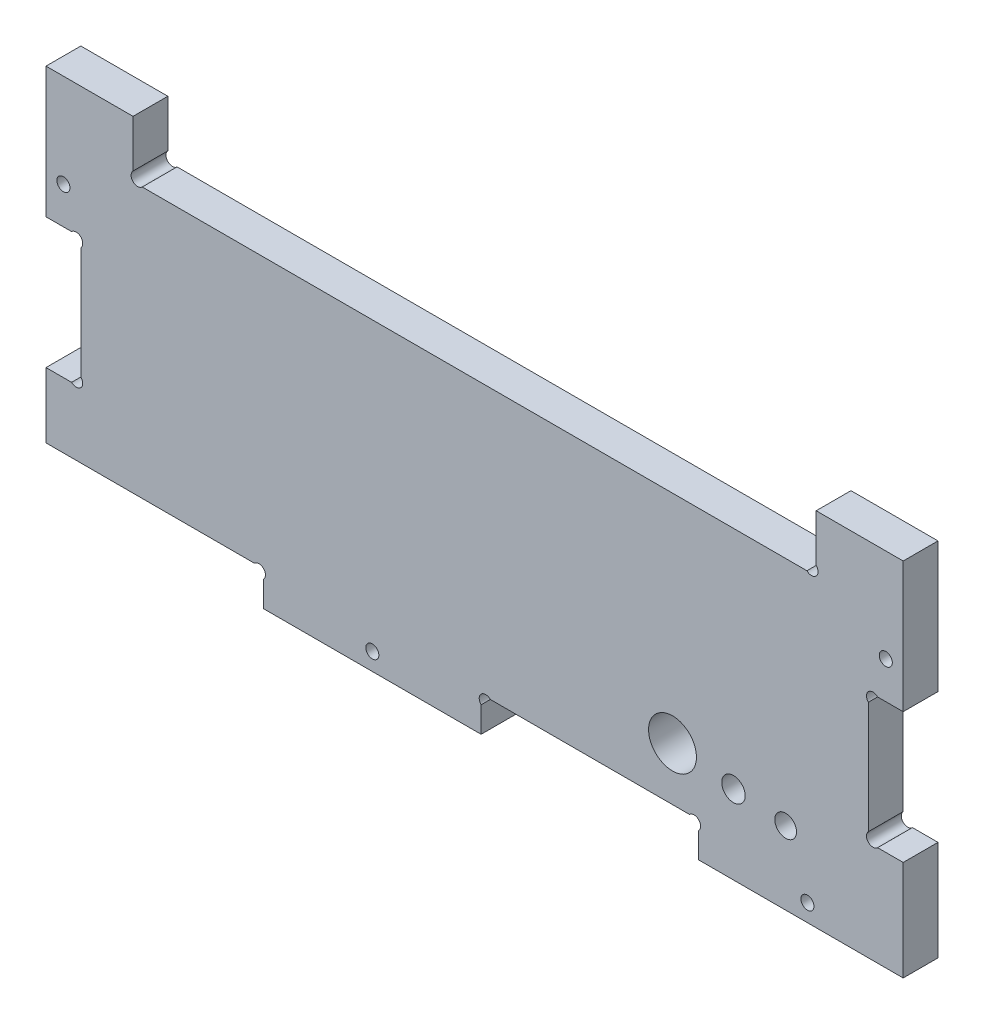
ISO-10303-21;
HEADER;
FILE_DESCRIPTION(('STEP AP214'),'2;1');
FILE_NAME('part.step','',(''),(''),'','','');
FILE_SCHEMA(('AUTOMOTIVE_DESIGN { 1 0 10303 214 1 1 1 1 }'));
ENDSEC;
DATA;
#1=APPLICATION_CONTEXT('core data for automotive mechanical design processes');
#2=APPLICATION_PROTOCOL_DEFINITION('international standard','automotive_design',2000,#1);
#3=PRODUCT_CONTEXT('',#1,'mechanical');
#4=PRODUCT('Part','Part','',(#3));
#5=PRODUCT_RELATED_PRODUCT_CATEGORY('part','',(#4));
#6=PRODUCT_DEFINITION_FORMATION('','',#4);
#7=PRODUCT_DEFINITION_CONTEXT('part definition',#1,'design');
#8=PRODUCT_DEFINITION('design','',#6,#7);
#9=PRODUCT_DEFINITION_SHAPE('','',#8);
#10=(LENGTH_UNIT() NAMED_UNIT(*) SI_UNIT(.MILLI.,.METRE.));
#11=(NAMED_UNIT(*) PLANE_ANGLE_UNIT() SI_UNIT($,.RADIAN.));
#12=(NAMED_UNIT(*) SI_UNIT($,.STERADIAN.) SOLID_ANGLE_UNIT());
#13=UNCERTAINTY_MEASURE_WITH_UNIT(LENGTH_MEASURE(1.E-05),#10,'distance_accuracy_value','');
#14=(GEOMETRIC_REPRESENTATION_CONTEXT(3) GLOBAL_UNCERTAINTY_ASSIGNED_CONTEXT((#13)) GLOBAL_UNIT_ASSIGNED_CONTEXT((#10,
#11,#12)) REPRESENTATION_CONTEXT('',''));
#15=CARTESIAN_POINT('',(0.,0.,0.));
#16=DIRECTION('',(0.,0.,1.));
#17=DIRECTION('',(1.,0.,0.));
#18=AXIS2_PLACEMENT_3D('',#15,#16,#17);
#19=CARTESIAN_POINT('',(-169.876335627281,-0.556227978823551,8.));
#20=DIRECTION('',(0.,0.,1.));
#21=DIRECTION('',(1.,0.,0.));
#22=AXIS2_PLACEMENT_3D('',#19,#20,#21);
#23=PLANE('',#22);
#24=CARTESIAN_POINT('',(-172.815675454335,36.8831118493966,8.));
#25=DIRECTION('',(0.,0.,1.));
#26=DIRECTION('',(1.,0.,0.));
#27=AXIS2_PLACEMENT_3D('',#24,#25,#26);
#28=CIRCLE('',#27,1.5);
#29=CARTESIAN_POINT('',(-171.315675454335,36.8831118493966,8.));
#30=VERTEX_POINT('',#29);
#31=EDGE_CURVE('E553',#30,#30,#28,.T.);
#32=ORIENTED_EDGE('',*,*,#31,.F.);
#33=EDGE_LOOP('',(#32));
#34=FACE_BOUND('',#33,.T.);
#35=CARTESIAN_POINT('',(-101.815675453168,-20.6168881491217,8.));
#36=DIRECTION('',(0.,0.,1.));
#37=DIRECTION('',(1.,0.,0.));
#38=AXIS2_PLACEMENT_3D('',#35,#36,#37);
#39=CIRCLE('',#38,1.5);
#40=CARTESIAN_POINT('',(-100.315675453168,-20.6168881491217,8.));
#41=VERTEX_POINT('',#40);
#42=EDGE_CURVE('E565',#41,#41,#39,.T.);
#43=ORIENTED_EDGE('',*,*,#42,.F.);
#44=EDGE_LOOP('',(#43));
#45=FACE_BOUND('',#44,.T.);
#46=CARTESIAN_POINT('',(-18.817975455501,-6.51688815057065,8.));
#47=DIRECTION('',(0.,0.,1.));
#48=DIRECTION('',(1.,0.,0.));
#49=AXIS2_PLACEMENT_3D('',#46,#47,#48);
#50=CIRCLE('',#49,2.7);
#51=CARTESIAN_POINT('',(-16.117975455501,-6.51688815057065,8.));
#52=VERTEX_POINT('',#51);
#53=EDGE_CURVE('E577',#52,#52,#50,.T.);
#54=ORIENTED_EDGE('',*,*,#53,.F.);
#55=EDGE_LOOP('',(#54));
#56=FACE_BOUND('',#55,.T.);
#57=DIRECTION('',(1.,0.,0.));
#58=VECTOR('',#57,1.);
#59=CARTESIAN_POINT('',(-128.936995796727,-16.6168881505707,8.));
#60=LINE('',#59,#58);
#61=CARTESIAN_POINT('',(-176.815675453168,-16.6168881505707,8.));
#62=VERTEX_POINT('',#61);
#63=CARTESIAN_POINT('',(-128.936995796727,-16.6168881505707,8.));
#64=VERTEX_POINT('',#63);
#65=EDGE_CURVE('E331',#62,#64,#60,.T.);
#66=ORIENTED_EDGE('',*,*,#65,.T.);
#67=CARTESIAN_POINT('',(-127.876335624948,-17.6775483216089,8.));
#68=DIRECTION('',(0.,0.,-1.));
#69=DIRECTION('',(1.,0.,0.));
#70=AXIS2_PLACEMENT_3D('',#67,#68,#69);
#71=CIRCLE('',#70,1.49999999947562);
#72=CARTESIAN_POINT('',(-126.815675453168,-18.7382084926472,8.));
#73=VERTEX_POINT('',#72);
#74=EDGE_CURVE('E161',#64,#73,#71,.T.);
#75=ORIENTED_EDGE('',*,*,#74,.T.);
#76=DIRECTION('',(0.,-1.,0.));
#77=VECTOR('',#76,1.);
#78=CARTESIAN_POINT('',(-126.815675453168,-24.6168881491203,8.));
#79=LINE('',#78,#77);
#80=CARTESIAN_POINT('',(-126.815675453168,-24.6168881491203,8.));
#81=VERTEX_POINT('',#80);
#82=EDGE_CURVE('E415',#73,#81,#79,.T.);
#83=ORIENTED_EDGE('',*,*,#82,.T.);
#84=DIRECTION('',(1.,0.,0.));
#85=VECTOR('',#84,1.);
#86=CARTESIAN_POINT('',(-76.8156754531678,-24.6168881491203,8.));
#87=LINE('',#86,#85);
#88=CARTESIAN_POINT('',(-76.8156754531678,-24.6168881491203,8.));
#89=VERTEX_POINT('',#88);
#90=EDGE_CURVE('E434',#81,#89,#87,.T.);
#91=ORIENTED_EDGE('',*,*,#90,.T.);
#92=DIRECTION('',(0.,1.,0.));
#93=VECTOR('',#92,1.);
#94=CARTESIAN_POINT('',(-76.8156754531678,-18.7382084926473,8.));
#95=LINE('',#94,#93);
#96=CARTESIAN_POINT('',(-76.8156754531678,-18.7382084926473,8.));
#97=VERTEX_POINT('',#96);
#98=EDGE_CURVE('E431',#89,#97,#95,.T.);
#99=ORIENTED_EDGE('',*,*,#98,.T.);
#100=CARTESIAN_POINT('',(-75.7550152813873,-17.6775483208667,8.));
#101=DIRECTION('',(0.,0.,-1.));
#102=DIRECTION('',(1.,0.,0.));
#103=AXIS2_PLACEMENT_3D('',#100,#101,#102);
#104=CIRCLE('',#103,1.50000000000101);
#105=CARTESIAN_POINT('',(-74.6943551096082,-16.6168881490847,8.));
#106=VERTEX_POINT('',#105);
#107=EDGE_CURVE('E433',#97,#106,#104,.T.);
#108=ORIENTED_EDGE('',*,*,#107,.T.);
#109=DIRECTION('',(1.,0.,0.));
#110=VECTOR('',#109,1.);
#111=CARTESIAN_POINT('',(-74.6943551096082,-16.6168881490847,8.));
#112=LINE('',#111,#110);
#113=CARTESIAN_POINT('',(-28.9369957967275,-16.6168881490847,8.));
#114=VERTEX_POINT('',#113);
#115=EDGE_CURVE('E436',#106,#114,#112,.T.);
#116=ORIENTED_EDGE('',*,*,#115,.T.);
#117=CARTESIAN_POINT('',(-27.8763356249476,-17.677548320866,8.));
#118=DIRECTION('',(0.,0.,-1.));
#119=DIRECTION('',(1.,0.,0.));
#120=AXIS2_PLACEMENT_3D('',#117,#118,#119);
#121=CIRCLE('',#120,1.500000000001);
#122=CARTESIAN_POINT('',(-26.8156754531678,-18.7382084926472,8.));
#123=VERTEX_POINT('',#122);
#124=EDGE_CURVE('E442',#114,#123,#121,.T.);
#125=ORIENTED_EDGE('',*,*,#124,.T.);
#126=DIRECTION('',(0.,-1.,0.));
#127=VECTOR('',#126,1.);
#128=CARTESIAN_POINT('',(-26.8156754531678,-24.6168881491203,8.));
#129=LINE('',#128,#127);
#130=CARTESIAN_POINT('',(-26.8156754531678,-24.6168881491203,8.));
#131=VERTEX_POINT('',#130);
#132=EDGE_CURVE('E444',#123,#131,#129,.T.);
#133=ORIENTED_EDGE('',*,*,#132,.T.);
#134=DIRECTION('',(1.,0.,0.));
#135=VECTOR('',#134,1.);
#136=CARTESIAN_POINT('',(20.1843245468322,-24.6168881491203,8.));
#137=LINE('',#136,#135);
#138=CARTESIAN_POINT('',(20.1843245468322,-24.6168881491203,8.));
#139=VERTEX_POINT('',#138);
#140=EDGE_CURVE('E446',#131,#139,#137,.T.);
#141=ORIENTED_EDGE('',*,*,#140,.T.);
#142=DIRECTION('',(0.,1.,0.));
#143=VECTOR('',#142,1.);
#144=CARTESIAN_POINT('',(20.1843245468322,-18.7382084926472,8.));
#145=LINE('',#144,#143);
#146=CARTESIAN_POINT('',(20.1843245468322,-1.61688815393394,8.));
#147=VERTEX_POINT('',#146);
#148=EDGE_CURVE('E448',#139,#147,#145,.T.);
#149=ORIENTED_EDGE('',*,*,#148,.T.);
#150=DIRECTION('',(-1.,0.,0.));
#151=VECTOR('',#150,1.);
#152=CARTESIAN_POINT('',(20.1843245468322,-1.61688815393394,8.));
#153=LINE('',#152,#151);
#154=CARTESIAN_POINT('',(14.3056448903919,-1.61688815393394,8.));
#155=VERTEX_POINT('',#154);
#156=EDGE_CURVE('E450',#147,#155,#153,.T.);
#157=ORIENTED_EDGE('',*,*,#156,.T.);
#158=CARTESIAN_POINT('',(13.2449847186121,-0.556227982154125,8.));
#159=DIRECTION('',(0.,0.,-1.));
#160=DIRECTION('',(1.,0.,0.));
#161=AXIS2_PLACEMENT_3D('',#158,#159,#160);
#162=CIRCLE('',#161,1.5);
#163=CARTESIAN_POINT('',(12.1843245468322,0.50443218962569,8.));
#164=VERTEX_POINT('',#163);
#165=EDGE_CURVE('E452',#155,#164,#162,.T.);
#166=ORIENTED_EDGE('',*,*,#165,.T.);
#167=DIRECTION('',(0.,1.,0.));
#168=VECTOR('',#167,1.);
#169=CARTESIAN_POINT('',(12.1843245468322,0.50443218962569,8.));
#170=LINE('',#169,#168);
#171=CARTESIAN_POINT('',(12.1843245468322,26.2617915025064,8.));
#172=VERTEX_POINT('',#171);
#173=EDGE_CURVE('E454',#164,#172,#170,.T.);
#174=ORIENTED_EDGE('',*,*,#173,.T.);
#175=CARTESIAN_POINT('',(13.2449847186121,27.3224516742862,8.));
#176=DIRECTION('',(0.,0.,-1.));
#177=DIRECTION('',(1.,0.,0.));
#178=AXIS2_PLACEMENT_3D('',#175,#176,#177);
#179=CIRCLE('',#178,1.5);
#180=CARTESIAN_POINT('',(14.3056448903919,28.383111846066,8.));
#181=VERTEX_POINT('',#180);
#182=EDGE_CURVE('E456',#172,#181,#179,.T.);
#183=ORIENTED_EDGE('',*,*,#182,.T.);
#184=DIRECTION('',(1.,0.,0.));
#185=VECTOR('',#184,1.);
#186=CARTESIAN_POINT('',(14.3056448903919,28.383111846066,8.));
#187=LINE('',#186,#185);
#188=CARTESIAN_POINT('',(20.1843245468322,28.383111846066,8.));
#189=VERTEX_POINT('',#188);
#190=EDGE_CURVE('E458',#181,#189,#187,.T.);
#191=ORIENTED_EDGE('',*,*,#190,.T.);
#192=DIRECTION('',(0.,1.,0.));
#193=VECTOR('',#192,1.);
#194=CARTESIAN_POINT('',(20.1843245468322,28.383111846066,8.));
#195=LINE('',#194,#193);
#196=CARTESIAN_POINT('',(20.1843245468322,58.3831118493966,8.));
#197=VERTEX_POINT('',#196);
#198=EDGE_CURVE('E460',#189,#197,#195,.T.);
#199=ORIENTED_EDGE('',*,*,#198,.T.);
#200=DIRECTION('',(-1.,0.,0.));
#201=VECTOR('',#200,1.);
#202=CARTESIAN_POINT('',(20.1843245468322,58.3831118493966,8.));
#203=LINE('',#202,#201);
#204=CARTESIAN_POINT('',(0.184324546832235,58.3831118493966,8.));
#205=VERTEX_POINT('',#204);
#206=EDGE_CURVE('E462',#197,#205,#203,.T.);
#207=ORIENTED_EDGE('',*,*,#206,.T.);
#208=DIRECTION('',(0.,-1.,0.));
#209=VECTOR('',#208,1.);
#210=CARTESIAN_POINT('',(0.184324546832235,58.3831118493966,8.));
#211=LINE('',#210,#209);
#212=CARTESIAN_POINT('',(0.184324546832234,47.5044321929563,8.));
#213=VERTEX_POINT('',#212);
#214=EDGE_CURVE('E464',#205,#213,#211,.T.);
#215=ORIENTED_EDGE('',*,*,#214,.T.);
#216=CARTESIAN_POINT('',(-0.876335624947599,46.4437720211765,8.));
#217=DIRECTION('',(0.,0.,-1.));
#218=DIRECTION('',(1.,0.,0.));
#219=AXIS2_PLACEMENT_3D('',#216,#217,#218);
#220=CIRCLE('',#219,1.50000000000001);
#221=CARTESIAN_POINT('',(-1.93699579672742,45.3831118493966,8.));
#222=VERTEX_POINT('',#221);
#223=EDGE_CURVE('E466',#213,#222,#220,.T.);
#224=ORIENTED_EDGE('',*,*,#223,.T.);
#225=DIRECTION('',(-1.,0.,0.));
#226=VECTOR('',#225,1.);
#227=CARTESIAN_POINT('',(-1.93699579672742,45.3831118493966,8.));
#228=LINE('',#227,#226);
#229=CARTESIAN_POINT('',(-154.694355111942,45.3831118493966,8.));
#230=VERTEX_POINT('',#229);
#231=EDGE_CURVE('E468',#222,#230,#228,.T.);
#232=ORIENTED_EDGE('',*,*,#231,.T.);
#233=CARTESIAN_POINT('',(-155.755015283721,46.4437720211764,8.));
#234=DIRECTION('',(0.,0.,-1.));
#235=DIRECTION('',(1.,0.,0.));
#236=AXIS2_PLACEMENT_3D('',#233,#234,#235);
#237=CIRCLE('',#236,1.49999999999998);
#238=CARTESIAN_POINT('',(-156.815675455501,47.5044321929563,8.));
#239=VERTEX_POINT('',#238);
#240=EDGE_CURVE('E470',#230,#239,#237,.T.);
#241=ORIENTED_EDGE('',*,*,#240,.T.);
#242=DIRECTION('',(0.,1.,0.));
#243=VECTOR('',#242,1.);
#244=CARTESIAN_POINT('',(-156.815675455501,58.3831118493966,8.));
#245=LINE('',#244,#243);
#246=CARTESIAN_POINT('',(-156.815675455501,58.3831118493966,8.));
#247=VERTEX_POINT('',#246);
#248=EDGE_CURVE('E472',#239,#247,#245,.T.);
#249=ORIENTED_EDGE('',*,*,#248,.T.);
#250=DIRECTION('',(-1.,0.,0.));
#251=VECTOR('',#250,1.);
#252=CARTESIAN_POINT('',(-176.815675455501,58.3831118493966,8.));
#253=LINE('',#252,#251);
#254=CARTESIAN_POINT('',(-176.815675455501,58.3831118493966,8.));
#255=VERTEX_POINT('',#254);
#256=EDGE_CURVE('E474',#247,#255,#253,.T.);
#257=ORIENTED_EDGE('',*,*,#256,.T.);
#258=DIRECTION('',(0.,-1.,0.));
#259=VECTOR('',#258,1.);
#260=CARTESIAN_POINT('',(-176.815675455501,45.3831118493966,8.));
#261=LINE('',#260,#259);
#262=CARTESIAN_POINT('',(-176.815675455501,28.3831118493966,8.));
#263=VERTEX_POINT('',#262);
#264=EDGE_CURVE('E476',#255,#263,#261,.T.);
#265=ORIENTED_EDGE('',*,*,#264,.T.);
#266=DIRECTION('',(1.,0.,0.));
#267=VECTOR('',#266,1.);
#268=CARTESIAN_POINT('',(-170.936995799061,28.3831118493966,8.));
#269=LINE('',#268,#267);
#270=CARTESIAN_POINT('',(-170.936995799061,28.3831118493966,8.));
#271=VERTEX_POINT('',#270);
#272=EDGE_CURVE('E478',#263,#271,#269,.T.);
#273=ORIENTED_EDGE('',*,*,#272,.T.);
#274=CARTESIAN_POINT('',(-169.876335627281,27.3224516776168,8.));
#275=DIRECTION('',(0.,0.,-1.));
#276=DIRECTION('',(1.,0.,0.));
#277=AXIS2_PLACEMENT_3D('',#274,#275,#276);
#278=CIRCLE('',#277,1.5);
#279=CARTESIAN_POINT('',(-168.815675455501,26.261791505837,8.));
#280=VERTEX_POINT('',#279);
#281=EDGE_CURVE('E480',#271,#280,#278,.T.);
#282=ORIENTED_EDGE('',*,*,#281,.T.);
#283=DIRECTION('',(0.,-1.,0.));
#284=VECTOR('',#283,1.);
#285=CARTESIAN_POINT('',(-168.815675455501,0.504432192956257,8.));
#286=LINE('',#285,#284);
#287=CARTESIAN_POINT('',(-168.815675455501,0.504432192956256,8.));
#288=VERTEX_POINT('',#287);
#289=EDGE_CURVE('E249',#280,#288,#286,.T.);
#290=ORIENTED_EDGE('',*,*,#289,.T.);
#291=CARTESIAN_POINT('',(-169.876335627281,-0.556227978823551,8.));
#292=DIRECTION('',(0.,0.,-1.));
#293=DIRECTION('',(1.,0.,0.));
#294=AXIS2_PLACEMENT_3D('',#291,#292,#293);
#295=CIRCLE('',#294,1.5);
#296=CARTESIAN_POINT('',(-170.936995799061,-1.61688815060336,8.));
#297=VERTEX_POINT('',#296);
#298=EDGE_CURVE('E243',#288,#297,#295,.T.);
#299=ORIENTED_EDGE('',*,*,#298,.T.);
#300=DIRECTION('',(-1.,0.,0.));
#301=VECTOR('',#300,1.);
#302=CARTESIAN_POINT('',(-176.815675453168,-1.61688815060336,8.));
#303=LINE('',#302,#301);
#304=CARTESIAN_POINT('',(-176.815675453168,-1.61688815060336,8.));
#305=VERTEX_POINT('',#304);
#306=EDGE_CURVE('E247',#297,#305,#303,.T.);
#307=ORIENTED_EDGE('',*,*,#306,.T.);
#308=DIRECTION('',(0.,-1.,0.));
#309=VECTOR('',#308,1.);
#310=CARTESIAN_POINT('',(-176.815675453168,-16.6168881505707,8.));
#311=LINE('',#310,#309);
#312=EDGE_CURVE('E49',#305,#62,#311,.T.);
#313=ORIENTED_EDGE('',*,*,#312,.T.);
#314=EDGE_LOOP('',(#66,#75,#83,#91,#99,#108,#116,#125,#133,#141,#149,#157,#166,#174,#183,#191,
#199,#207,#215,#224,#232,#241,#249,#257,#265,#273,#282,#290,#299,#307,#313));
#315=FACE_BOUND('',#314,.T.);
#316=CARTESIAN_POINT('',(-32.8343189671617,-4.42688815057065,8.));
#317=DIRECTION('',(0.,0.,1.));
#318=DIRECTION('',(1.,0.,0.));
#319=AXIS2_PLACEMENT_3D('',#316,#317,#318);
#320=CIRCLE('',#319,5.5);
#321=CARTESIAN_POINT('',(-27.3343189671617,-4.42688815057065,8.));
#322=VERTEX_POINT('',#321);
#323=EDGE_CURVE('E271',#322,#322,#320,.T.);
#324=ORIENTED_EDGE('',*,*,#323,.F.);
#325=EDGE_LOOP('',(#324));
#326=FACE_BOUND('',#325,.T.);
#327=CARTESIAN_POINT('',(-6.82870161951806,-7.81688815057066,8.));
#328=DIRECTION('',(0.,0.,1.));
#329=DIRECTION('',(1.,0.,0.));
#330=AXIS2_PLACEMENT_3D('',#327,#328,#329);
#331=CIRCLE('',#330,2.5);
#332=CARTESIAN_POINT('',(-4.32870161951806,-7.81688815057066,8.));
#333=VERTEX_POINT('',#332);
#334=EDGE_CURVE('E571',#333,#333,#331,.T.);
#335=ORIENTED_EDGE('',*,*,#334,.F.);
#336=EDGE_LOOP('',(#335));
#337=FACE_BOUND('',#336,.T.);
#338=CARTESIAN_POINT('',(-1.81567545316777,-20.6168881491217,8.));
#339=DIRECTION('',(0.,0.,1.));
#340=DIRECTION('',(1.,0.,0.));
#341=AXIS2_PLACEMENT_3D('',#338,#339,#340);
#342=CIRCLE('',#341,1.5);
#343=CARTESIAN_POINT('',(-0.315675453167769,-20.6168881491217,8.));
#344=VERTEX_POINT('',#343);
#345=EDGE_CURVE('E559',#344,#344,#342,.T.);
#346=ORIENTED_EDGE('',*,*,#345,.F.);
#347=EDGE_LOOP('',(#346));
#348=FACE_BOUND('',#347,.T.);
#349=CARTESIAN_POINT('',(16.1843245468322,36.8831118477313,8.));
#350=DIRECTION('',(0.,0.,1.));
#351=DIRECTION('',(1.,0.,0.));
#352=AXIS2_PLACEMENT_3D('',#349,#350,#351);
#353=CIRCLE('',#352,1.5);
#354=CARTESIAN_POINT('',(17.6843245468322,36.8831118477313,8.));
#355=VERTEX_POINT('',#354);
#356=EDGE_CURVE('E544',#355,#355,#353,.T.);
#357=ORIENTED_EDGE('',*,*,#356,.F.);
#358=EDGE_LOOP('',(#357));
#359=FACE_BOUND('',#358,.T.);
#360=ADVANCED_FACE('F32',(#34,#45,#56,#315,#326,#337,#348,#359),#23,.T.);
#361=CARTESIAN_POINT('',(-169.876335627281,-0.556227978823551,0.));
#362=DIRECTION('',(0.,0.,1.));
#363=DIRECTION('',(1.,0.,0.));
#364=AXIS2_PLACEMENT_3D('',#361,#362,#363);
#365=PLANE('',#364);
#366=CARTESIAN_POINT('',(-172.815675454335,36.8831118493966,0.));
#367=DIRECTION('',(0.,0.,1.));
#368=DIRECTION('',(1.,0.,0.));
#369=AXIS2_PLACEMENT_3D('',#366,#367,#368);
#370=CIRCLE('',#369,1.5);
#371=CARTESIAN_POINT('',(-171.315675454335,36.8831118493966,0.));
#372=VERTEX_POINT('',#371);
#373=EDGE_CURVE('E550',#372,#372,#370,.T.);
#374=ORIENTED_EDGE('',*,*,#373,.T.);
#375=EDGE_LOOP('',(#374));
#376=FACE_BOUND('',#375,.T.);
#377=CARTESIAN_POINT('',(-101.815675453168,-20.6168881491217,0.));
#378=DIRECTION('',(0.,0.,1.));
#379=DIRECTION('',(1.,0.,0.));
#380=AXIS2_PLACEMENT_3D('',#377,#378,#379);
#381=CIRCLE('',#380,1.5);
#382=CARTESIAN_POINT('',(-100.315675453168,-20.6168881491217,0.));
#383=VERTEX_POINT('',#382);
#384=EDGE_CURVE('E562',#383,#383,#381,.T.);
#385=ORIENTED_EDGE('',*,*,#384,.T.);
#386=EDGE_LOOP('',(#385));
#387=FACE_BOUND('',#386,.T.);
#388=CARTESIAN_POINT('',(-18.817975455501,-6.51688815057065,0.));
#389=DIRECTION('',(0.,0.,1.));
#390=DIRECTION('',(1.,0.,0.));
#391=AXIS2_PLACEMENT_3D('',#388,#389,#390);
#392=CIRCLE('',#391,2.7);
#393=CARTESIAN_POINT('',(-16.117975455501,-6.51688815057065,0.));
#394=VERTEX_POINT('',#393);
#395=EDGE_CURVE('E574',#394,#394,#392,.T.);
#396=ORIENTED_EDGE('',*,*,#395,.T.);
#397=EDGE_LOOP('',(#396));
#398=FACE_BOUND('',#397,.T.);
#399=DIRECTION('',(1.,0.,0.));
#400=VECTOR('',#399,1.);
#401=CARTESIAN_POINT('',(-128.936995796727,-16.6168881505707,0.));
#402=LINE('',#401,#400);
#403=CARTESIAN_POINT('',(-176.815675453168,-16.6168881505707,0.));
#404=VERTEX_POINT('',#403);
#405=CARTESIAN_POINT('',(-128.936995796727,-16.6168881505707,0.));
#406=VERTEX_POINT('',#405);
#407=EDGE_CURVE('E267',#404,#406,#402,.T.);
#408=ORIENTED_EDGE('',*,*,#407,.F.);
#409=DIRECTION('',(0.,-1.,0.));
#410=VECTOR('',#409,1.);
#411=CARTESIAN_POINT('',(-176.815675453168,-16.6168881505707,0.));
#412=LINE('',#411,#410);
#413=CARTESIAN_POINT('',(-176.815675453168,-1.61688815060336,0.));
#414=VERTEX_POINT('',#413);
#415=EDGE_CURVE('E153',#414,#404,#412,.T.);
#416=ORIENTED_EDGE('',*,*,#415,.F.);
#417=DIRECTION('',(-1.,0.,0.));
#418=VECTOR('',#417,1.);
#419=CARTESIAN_POINT('',(-176.815675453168,-1.61688815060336,0.));
#420=LINE('',#419,#418);
#421=CARTESIAN_POINT('',(-170.936995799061,-1.61688815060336,0.));
#422=VERTEX_POINT('',#421);
#423=EDGE_CURVE('E147',#422,#414,#420,.T.);
#424=ORIENTED_EDGE('',*,*,#423,.F.);
#425=CARTESIAN_POINT('',(-169.876335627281,-0.556227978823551,0.));
#426=DIRECTION('',(0.,0.,-1.));
#427=DIRECTION('',(1.,0.,0.));
#428=AXIS2_PLACEMENT_3D('',#425,#426,#427);
#429=CIRCLE('',#428,1.5);
#430=CARTESIAN_POINT('',(-168.815675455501,0.504432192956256,0.));
#431=VERTEX_POINT('',#430);
#432=EDGE_CURVE('E257',#431,#422,#429,.T.);
#433=ORIENTED_EDGE('',*,*,#432,.F.);
#434=DIRECTION('',(0.,-1.,0.));
#435=VECTOR('',#434,1.);
#436=CARTESIAN_POINT('',(-168.815675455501,0.504432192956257,0.));
#437=LINE('',#436,#435);
#438=CARTESIAN_POINT('',(-168.815675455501,26.261791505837,0.));
#439=VERTEX_POINT('',#438);
#440=EDGE_CURVE('E326',#439,#431,#437,.T.);
#441=ORIENTED_EDGE('',*,*,#440,.F.);
#442=CARTESIAN_POINT('',(-169.876335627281,27.3224516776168,0.));
#443=DIRECTION('',(0.,0.,-1.));
#444=DIRECTION('',(1.,0.,0.));
#445=AXIS2_PLACEMENT_3D('',#442,#443,#444);
#446=CIRCLE('',#445,1.5);
#447=CARTESIAN_POINT('',(-170.936995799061,28.3831118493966,0.));
#448=VERTEX_POINT('',#447);
#449=EDGE_CURVE('E324',#448,#439,#446,.T.);
#450=ORIENTED_EDGE('',*,*,#449,.F.);
#451=DIRECTION('',(1.,0.,0.));
#452=VECTOR('',#451,1.);
#453=CARTESIAN_POINT('',(-170.936995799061,28.3831118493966,0.));
#454=LINE('',#453,#452);
#455=CARTESIAN_POINT('',(-176.815675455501,28.3831118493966,0.));
#456=VERTEX_POINT('',#455);
#457=EDGE_CURVE('E322',#456,#448,#454,.T.);
#458=ORIENTED_EDGE('',*,*,#457,.F.);
#459=DIRECTION('',(0.,-1.,0.));
#460=VECTOR('',#459,1.);
#461=CARTESIAN_POINT('',(-176.815675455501,28.3831118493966,0.));
#462=LINE('',#461,#460);
#463=CARTESIAN_POINT('',(-176.815675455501,58.3831118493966,0.));
#464=VERTEX_POINT('',#463);
#465=EDGE_CURVE('E320',#464,#456,#462,.T.);
#466=ORIENTED_EDGE('',*,*,#465,.F.);
#467=DIRECTION('',(-1.,0.,0.));
#468=VECTOR('',#467,1.);
#469=CARTESIAN_POINT('',(-176.815675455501,58.3831118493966,0.));
#470=LINE('',#469,#468);
#471=CARTESIAN_POINT('',(-156.815675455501,58.3831118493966,0.));
#472=VERTEX_POINT('',#471);
#473=EDGE_CURVE('E317',#472,#464,#470,.T.);
#474=ORIENTED_EDGE('',*,*,#473,.F.);
#475=DIRECTION('',(0.,1.,0.));
#476=VECTOR('',#475,1.);
#477=CARTESIAN_POINT('',(-156.815675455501,58.3831118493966,0.));
#478=LINE('',#477,#476);
#479=CARTESIAN_POINT('',(-156.815675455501,47.5044321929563,0.));
#480=VERTEX_POINT('',#479);
#481=EDGE_CURVE('E315',#480,#472,#478,.T.);
#482=ORIENTED_EDGE('',*,*,#481,.F.);
#483=CARTESIAN_POINT('',(-155.755015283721,46.4437720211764,0.));
#484=DIRECTION('',(0.,0.,-1.));
#485=DIRECTION('',(1.,0.,0.));
#486=AXIS2_PLACEMENT_3D('',#483,#484,#485);
#487=CIRCLE('',#486,1.49999999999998);
#488=CARTESIAN_POINT('',(-154.694355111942,45.3831118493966,0.));
#489=VERTEX_POINT('',#488);
#490=EDGE_CURVE('E313',#489,#480,#487,.T.);
#491=ORIENTED_EDGE('',*,*,#490,.F.);
#492=DIRECTION('',(-1.,0.,0.));
#493=VECTOR('',#492,1.);
#494=CARTESIAN_POINT('',(-1.93699579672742,45.3831118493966,0.));
#495=LINE('',#494,#493);
#496=CARTESIAN_POINT('',(-1.93699579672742,45.3831118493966,0.));
#497=VERTEX_POINT('',#496);
#498=EDGE_CURVE('E311',#497,#489,#495,.T.);
#499=ORIENTED_EDGE('',*,*,#498,.F.);
#500=CARTESIAN_POINT('',(-0.876335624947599,46.4437720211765,0.));
#501=DIRECTION('',(0.,0.,-1.));
#502=DIRECTION('',(1.,0.,0.));
#503=AXIS2_PLACEMENT_3D('',#500,#501,#502);
#504=CIRCLE('',#503,1.50000000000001);
#505=CARTESIAN_POINT('',(0.184324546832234,47.5044321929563,0.));
#506=VERTEX_POINT('',#505);
#507=EDGE_CURVE('E309',#506,#497,#504,.T.);
#508=ORIENTED_EDGE('',*,*,#507,.F.);
#509=DIRECTION('',(0.,-1.,0.));
#510=VECTOR('',#509,1.);
#511=CARTESIAN_POINT('',(0.184324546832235,58.3831118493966,0.));
#512=LINE('',#511,#510);
#513=CARTESIAN_POINT('',(0.184324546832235,58.3831118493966,0.));
#514=VERTEX_POINT('',#513);
#515=EDGE_CURVE('E307',#514,#506,#512,.T.);
#516=ORIENTED_EDGE('',*,*,#515,.F.);
#517=DIRECTION('',(-1.,0.,0.));
#518=VECTOR('',#517,1.);
#519=CARTESIAN_POINT('',(20.1843245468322,58.3831118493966,0.));
#520=LINE('',#519,#518);
#521=CARTESIAN_POINT('',(20.1843245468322,58.3831118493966,0.));
#522=VERTEX_POINT('',#521);
#523=EDGE_CURVE('E305',#522,#514,#520,.T.);
#524=ORIENTED_EDGE('',*,*,#523,.F.);
#525=DIRECTION('',(0.,1.,0.));
#526=VECTOR('',#525,1.);
#527=CARTESIAN_POINT('',(20.1843245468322,45.3831118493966,0.));
#528=LINE('',#527,#526);
#529=CARTESIAN_POINT('',(20.1843245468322,28.383111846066,0.));
#530=VERTEX_POINT('',#529);
#531=EDGE_CURVE('E303',#530,#522,#528,.T.);
#532=ORIENTED_EDGE('',*,*,#531,.F.);
#533=DIRECTION('',(1.,0.,0.));
#534=VECTOR('',#533,1.);
#535=CARTESIAN_POINT('',(14.3056448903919,28.383111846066,0.));
#536=LINE('',#535,#534);
#537=CARTESIAN_POINT('',(14.3056448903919,28.383111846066,0.));
#538=VERTEX_POINT('',#537);
#539=EDGE_CURVE('E300',#538,#530,#536,.T.);
#540=ORIENTED_EDGE('',*,*,#539,.F.);
#541=CARTESIAN_POINT('',(13.2449847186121,27.3224516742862,0.));
#542=DIRECTION('',(0.,0.,-1.));
#543=DIRECTION('',(1.,0.,0.));
#544=AXIS2_PLACEMENT_3D('',#541,#542,#543);
#545=CIRCLE('',#544,1.5);
#546=CARTESIAN_POINT('',(12.1843245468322,26.2617915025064,0.));
#547=VERTEX_POINT('',#546);
#548=EDGE_CURVE('E298',#547,#538,#545,.T.);
#549=ORIENTED_EDGE('',*,*,#548,.F.);
#550=DIRECTION('',(0.,1.,0.));
#551=VECTOR('',#550,1.);
#552=CARTESIAN_POINT('',(12.1843245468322,0.50443218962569,0.));
#553=LINE('',#552,#551);
#554=CARTESIAN_POINT('',(12.1843245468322,0.50443218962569,0.));
#555=VERTEX_POINT('',#554);
#556=EDGE_CURVE('E296',#555,#547,#553,.T.);
#557=ORIENTED_EDGE('',*,*,#556,.F.);
#558=CARTESIAN_POINT('',(13.2449847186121,-0.556227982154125,0.));
#559=DIRECTION('',(0.,0.,-1.));
#560=DIRECTION('',(1.,0.,0.));
#561=AXIS2_PLACEMENT_3D('',#558,#559,#560);
#562=CIRCLE('',#561,1.5);
#563=CARTESIAN_POINT('',(14.3056448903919,-1.61688815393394,0.));
#564=VERTEX_POINT('',#563);
#565=EDGE_CURVE('E294',#564,#555,#562,.T.);
#566=ORIENTED_EDGE('',*,*,#565,.F.);
#567=DIRECTION('',(-1.,0.,0.));
#568=VECTOR('',#567,1.);
#569=CARTESIAN_POINT('',(20.1843245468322,-1.61688815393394,0.));
#570=LINE('',#569,#568);
#571=CARTESIAN_POINT('',(20.1843245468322,-1.61688815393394,0.));
#572=VERTEX_POINT('',#571);
#573=EDGE_CURVE('E292',#572,#564,#570,.T.);
#574=ORIENTED_EDGE('',*,*,#573,.F.);
#575=DIRECTION('',(0.,1.,0.));
#576=VECTOR('',#575,1.);
#577=CARTESIAN_POINT('',(20.1843245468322,-18.7382084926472,0.));
#578=LINE('',#577,#576);
#579=CARTESIAN_POINT('',(20.1843245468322,-24.6168881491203,0.));
#580=VERTEX_POINT('',#579);
#581=EDGE_CURVE('E290',#580,#572,#578,.T.);
#582=ORIENTED_EDGE('',*,*,#581,.F.);
#583=DIRECTION('',(1.,0.,0.));
#584=VECTOR('',#583,1.);
#585=CARTESIAN_POINT('',(20.1843245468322,-24.6168881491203,0.));
#586=LINE('',#585,#584);
#587=CARTESIAN_POINT('',(-26.8156754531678,-24.6168881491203,0.));
#588=VERTEX_POINT('',#587);
#589=EDGE_CURVE('E287',#588,#580,#586,.T.);
#590=ORIENTED_EDGE('',*,*,#589,.F.);
#591=DIRECTION('',(0.,-1.,0.));
#592=VECTOR('',#591,1.);
#593=CARTESIAN_POINT('',(-26.8156754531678,-24.6168881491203,0.));
#594=LINE('',#593,#592);
#595=CARTESIAN_POINT('',(-26.8156754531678,-18.7382084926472,0.));
#596=VERTEX_POINT('',#595);
#597=EDGE_CURVE('E285',#596,#588,#594,.T.);
#598=ORIENTED_EDGE('',*,*,#597,.F.);
#599=CARTESIAN_POINT('',(-27.8763356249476,-17.677548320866,0.));
#600=DIRECTION('',(0.,0.,-1.));
#601=DIRECTION('',(1.,0.,0.));
#602=AXIS2_PLACEMENT_3D('',#599,#600,#601);
#603=CIRCLE('',#602,1.500000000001);
#604=CARTESIAN_POINT('',(-28.9369957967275,-16.6168881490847,0.));
#605=VERTEX_POINT('',#604);
#606=EDGE_CURVE('E283',#605,#596,#603,.T.);
#607=ORIENTED_EDGE('',*,*,#606,.F.);
#608=DIRECTION('',(1.,0.,0.));
#609=VECTOR('',#608,1.);
#610=CARTESIAN_POINT('',(-74.6943551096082,-16.6168881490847,0.));
#611=LINE('',#610,#609);
#612=CARTESIAN_POINT('',(-74.6943551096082,-16.6168881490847,0.));
#613=VERTEX_POINT('',#612);
#614=EDGE_CURVE('E281',#613,#605,#611,.T.);
#615=ORIENTED_EDGE('',*,*,#614,.F.);
#616=CARTESIAN_POINT('',(-75.7550152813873,-17.6775483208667,0.));
#617=DIRECTION('',(0.,0.,-1.));
#618=DIRECTION('',(1.,0.,0.));
#619=AXIS2_PLACEMENT_3D('',#616,#617,#618);
#620=CIRCLE('',#619,1.50000000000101);
#621=CARTESIAN_POINT('',(-76.8156754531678,-18.7382084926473,0.));
#622=VERTEX_POINT('',#621);
#623=EDGE_CURVE('E279',#622,#613,#620,.T.);
#624=ORIENTED_EDGE('',*,*,#623,.F.);
#625=DIRECTION('',(0.,1.,0.));
#626=VECTOR('',#625,1.);
#627=CARTESIAN_POINT('',(-76.8156754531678,-18.7382084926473,0.));
#628=LINE('',#627,#626);
#629=CARTESIAN_POINT('',(-76.8156754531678,-24.6168881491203,0.));
#630=VERTEX_POINT('',#629);
#631=EDGE_CURVE('E277',#630,#622,#628,.T.);
#632=ORIENTED_EDGE('',*,*,#631,.F.);
#633=DIRECTION('',(1.,0.,0.));
#634=VECTOR('',#633,1.);
#635=CARTESIAN_POINT('',(-76.8156754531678,-24.6168881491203,0.));
#636=LINE('',#635,#634);
#637=CARTESIAN_POINT('',(-126.815675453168,-24.6168881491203,0.));
#638=VERTEX_POINT('',#637);
#639=EDGE_CURVE('E275',#638,#630,#636,.T.);
#640=ORIENTED_EDGE('',*,*,#639,.F.);
#641=DIRECTION('',(0.,-1.,0.));
#642=VECTOR('',#641,1.);
#643=CARTESIAN_POINT('',(-126.815675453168,-24.6168881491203,0.));
#644=LINE('',#643,#642);
#645=CARTESIAN_POINT('',(-126.815675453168,-18.7382084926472,0.));
#646=VERTEX_POINT('',#645);
#647=EDGE_CURVE('E273',#646,#638,#644,.T.);
#648=ORIENTED_EDGE('',*,*,#647,.F.);
#649=CARTESIAN_POINT('',(-127.876335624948,-17.6775483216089,0.));
#650=DIRECTION('',(0.,0.,-1.));
#651=DIRECTION('',(1.,0.,0.));
#652=AXIS2_PLACEMENT_3D('',#649,#650,#651);
#653=CIRCLE('',#652,1.49999999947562);
#654=EDGE_CURVE('E270',#406,#646,#653,.T.);
#655=ORIENTED_EDGE('',*,*,#654,.F.);
#656=EDGE_LOOP('',(#408,#416,#424,#433,#441,#450,#458,#466,#474,#482,#491,#499,#508,#516,#524,
#532,#540,#549,#557,#566,#574,#582,#590,#598,#607,#615,#624,#632,#640,#648,#655));
#657=FACE_BOUND('',#656,.T.);
#658=CARTESIAN_POINT('',(-32.8343189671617,-4.42688815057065,0.));
#659=DIRECTION('',(0.,0.,1.));
#660=DIRECTION('',(1.,0.,0.));
#661=AXIS2_PLACEMENT_3D('',#658,#659,#660);
#662=CIRCLE('',#661,5.5);
#663=CARTESIAN_POINT('',(-27.3343189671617,-4.42688815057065,0.));
#664=VERTEX_POINT('',#663);
#665=EDGE_CURVE('E580',#664,#664,#662,.T.);
#666=ORIENTED_EDGE('',*,*,#665,.T.);
#667=EDGE_LOOP('',(#666));
#668=FACE_BOUND('',#667,.T.);
#669=CARTESIAN_POINT('',(-6.82870161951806,-7.81688815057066,0.));
#670=DIRECTION('',(0.,0.,1.));
#671=DIRECTION('',(1.,0.,0.));
#672=AXIS2_PLACEMENT_3D('',#669,#670,#671);
#673=CIRCLE('',#672,2.5);
#674=CARTESIAN_POINT('',(-4.32870161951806,-7.81688815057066,0.));
#675=VERTEX_POINT('',#674);
#676=EDGE_CURVE('E568',#675,#675,#673,.T.);
#677=ORIENTED_EDGE('',*,*,#676,.T.);
#678=EDGE_LOOP('',(#677));
#679=FACE_BOUND('',#678,.T.);
#680=CARTESIAN_POINT('',(-1.81567545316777,-20.6168881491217,0.));
#681=DIRECTION('',(0.,0.,1.));
#682=DIRECTION('',(1.,0.,0.));
#683=AXIS2_PLACEMENT_3D('',#680,#681,#682);
#684=CIRCLE('',#683,1.5);
#685=CARTESIAN_POINT('',(-0.315675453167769,-20.6168881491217,0.));
#686=VERTEX_POINT('',#685);
#687=EDGE_CURVE('E556',#686,#686,#684,.T.);
#688=ORIENTED_EDGE('',*,*,#687,.T.);
#689=EDGE_LOOP('',(#688));
#690=FACE_BOUND('',#689,.T.);
#691=CARTESIAN_POINT('',(16.1843245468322,36.8831118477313,0.));
#692=DIRECTION('',(0.,0.,1.));
#693=DIRECTION('',(1.,0.,0.));
#694=AXIS2_PLACEMENT_3D('',#691,#692,#693);
#695=CIRCLE('',#694,1.5);
#696=CARTESIAN_POINT('',(17.6843245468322,36.8831118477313,0.));
#697=VERTEX_POINT('',#696);
#698=EDGE_CURVE('E547',#697,#697,#695,.T.);
#699=ORIENTED_EDGE('',*,*,#698,.T.);
#700=EDGE_LOOP('',(#699));
#701=FACE_BOUND('',#700,.T.);
#702=ADVANCED_FACE('F419',(#376,#387,#398,#657,#668,#679,#690,#701),#365,.F.);
#703=CARTESIAN_POINT('',(-128.936995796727,-16.6168881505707,8.));
#704=DIRECTION('',(0.,1.,0.));
#705=DIRECTION('',(-1.,0.,0.));
#706=AXIS2_PLACEMENT_3D('',#703,#704,#705);
#707=PLANE('',#706);
#708=ORIENTED_EDGE('',*,*,#407,.T.);
#709=DIRECTION('',(0.,0.,-1.));
#710=VECTOR('',#709,1.);
#711=CARTESIAN_POINT('',(-128.936995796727,-16.6168881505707,8.));
#712=LINE('',#711,#710);
#713=EDGE_CURVE('E11',#64,#406,#712,.T.);
#714=ORIENTED_EDGE('',*,*,#713,.F.);
#715=ORIENTED_EDGE('',*,*,#65,.F.);
#716=DIRECTION('',(0.,0.,-1.));
#717=VECTOR('',#716,1.);
#718=CARTESIAN_POINT('',(-176.815675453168,-16.6168881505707,8.));
#719=LINE('',#718,#717);
#720=EDGE_CURVE('E263',#62,#404,#719,.T.);
#721=ORIENTED_EDGE('',*,*,#720,.T.);
#722=EDGE_LOOP('',(#708,#714,#715,#721));
#723=FACE_BOUND('',#722,.T.);
#724=ADVANCED_FACE('F34',(#723),#707,.F.);
#725=CARTESIAN_POINT('',(-127.876335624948,-17.6775483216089,8.));
#726=DIRECTION('',(0.,0.,-1.));
#727=DIRECTION('',(-1.,0.,0.));
#728=AXIS2_PLACEMENT_3D('',#725,#726,#727);
#729=CYLINDRICAL_SURFACE('',#728,1.49999999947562);
#730=ORIENTED_EDGE('',*,*,#654,.T.);
#731=DIRECTION('',(0.,0.,-1.));
#732=VECTOR('',#731,1.);
#733=CARTESIAN_POINT('',(-126.815675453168,-18.7382084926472,8.));
#734=LINE('',#733,#732);
#735=EDGE_CURVE('E41',#73,#646,#734,.T.);
#736=ORIENTED_EDGE('',*,*,#735,.F.);
#737=ORIENTED_EDGE('',*,*,#74,.F.);
#738=ORIENTED_EDGE('',*,*,#713,.T.);
#739=EDGE_LOOP('',(#730,#736,#737,#738));
#740=FACE_BOUND('',#739,.T.);
#741=ADVANCED_FACE('F909',(#740),#729,.F.);
#742=CARTESIAN_POINT('',(-126.815675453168,-24.6168881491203,8.));
#743=DIRECTION('',(1.,0.,0.));
#744=DIRECTION('',(0.,0.,-1.));
#745=AXIS2_PLACEMENT_3D('',#742,#743,#744);
#746=PLANE('',#745);
#747=ORIENTED_EDGE('',*,*,#647,.T.);
#748=DIRECTION('',(0.,0.,-1.));
#749=VECTOR('',#748,1.);
#750=CARTESIAN_POINT('',(-126.815675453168,-24.6168881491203,8.));
#751=LINE('',#750,#749);
#752=EDGE_CURVE('E407',#81,#638,#751,.T.);
#753=ORIENTED_EDGE('',*,*,#752,.F.);
#754=ORIENTED_EDGE('',*,*,#82,.F.);
#755=ORIENTED_EDGE('',*,*,#735,.T.);
#756=EDGE_LOOP('',(#747,#753,#754,#755));
#757=FACE_BOUND('',#756,.T.);
#758=ADVANCED_FACE('F413',(#757),#746,.F.);
#759=CARTESIAN_POINT('',(-76.8156754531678,-24.6168881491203,8.));
#760=DIRECTION('',(0.,1.,0.));
#761=DIRECTION('',(-1.,0.,0.));
#762=AXIS2_PLACEMENT_3D('',#759,#760,#761);
#763=PLANE('',#762);
#764=ORIENTED_EDGE('',*,*,#639,.T.);
#765=DIRECTION('',(0.,0.,-1.));
#766=VECTOR('',#765,1.);
#767=CARTESIAN_POINT('',(-76.8156754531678,-24.6168881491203,8.));
#768=LINE('',#767,#766);
#769=EDGE_CURVE('E404',#89,#630,#768,.T.);
#770=ORIENTED_EDGE('',*,*,#769,.F.);
#771=ORIENTED_EDGE('',*,*,#90,.F.);
#772=ORIENTED_EDGE('',*,*,#752,.T.);
#773=EDGE_LOOP('',(#764,#770,#771,#772));
#774=FACE_BOUND('',#773,.T.);
#775=ADVANCED_FACE('F425',(#774),#763,.F.);
#776=CARTESIAN_POINT('',(-76.8156754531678,-18.7382084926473,8.));
#777=DIRECTION('',(-1.,0.,0.));
#778=DIRECTION('',(0.,0.,1.));
#779=AXIS2_PLACEMENT_3D('',#776,#777,#778);
#780=PLANE('',#779);
#781=ORIENTED_EDGE('',*,*,#631,.T.);
#782=DIRECTION('',(0.,0.,-1.));
#783=VECTOR('',#782,1.);
#784=CARTESIAN_POINT('',(-76.8156754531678,-18.7382084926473,8.));
#785=LINE('',#784,#783);
#786=EDGE_CURVE('E401',#97,#622,#785,.T.);
#787=ORIENTED_EDGE('',*,*,#786,.F.);
#788=ORIENTED_EDGE('',*,*,#98,.F.);
#789=ORIENTED_EDGE('',*,*,#769,.T.);
#790=EDGE_LOOP('',(#781,#787,#788,#789));
#791=FACE_BOUND('',#790,.T.);
#792=ADVANCED_FACE('F429',(#791),#780,.F.);
#793=CARTESIAN_POINT('',(-75.7550152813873,-17.6775483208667,8.));
#794=DIRECTION('',(0.,0.,-1.));
#795=DIRECTION('',(-1.,0.,0.));
#796=AXIS2_PLACEMENT_3D('',#793,#794,#795);
#797=CYLINDRICAL_SURFACE('',#796,1.50000000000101);
#798=ORIENTED_EDGE('',*,*,#623,.T.);
#799=DIRECTION('',(0.,0.,-1.));
#800=VECTOR('',#799,1.);
#801=CARTESIAN_POINT('',(-74.6943551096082,-16.6168881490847,8.));
#802=LINE('',#801,#800);
#803=EDGE_CURVE('E398',#106,#613,#802,.T.);
#804=ORIENTED_EDGE('',*,*,#803,.F.);
#805=ORIENTED_EDGE('',*,*,#107,.F.);
#806=ORIENTED_EDGE('',*,*,#786,.T.);
#807=EDGE_LOOP('',(#798,#804,#805,#806));
#808=FACE_BOUND('',#807,.T.);
#809=ADVANCED_FACE('F874',(#808),#797,.F.);
#810=CARTESIAN_POINT('',(-74.6943551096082,-16.6168881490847,8.));
#811=DIRECTION('',(0.,1.,0.));
#812=DIRECTION('',(-1.,0.,0.));
#813=AXIS2_PLACEMENT_3D('',#810,#811,#812);
#814=PLANE('',#813);
#815=ORIENTED_EDGE('',*,*,#614,.T.);
#816=DIRECTION('',(0.,0.,-1.));
#817=VECTOR('',#816,1.);
#818=CARTESIAN_POINT('',(-28.9369957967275,-16.6168881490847,8.));
#819=LINE('',#818,#817);
#820=EDGE_CURVE('E395',#114,#605,#819,.T.);
#821=ORIENTED_EDGE('',*,*,#820,.F.);
#822=ORIENTED_EDGE('',*,*,#115,.F.);
#823=ORIENTED_EDGE('',*,*,#803,.T.);
#824=EDGE_LOOP('',(#815,#821,#822,#823));
#825=FACE_BOUND('',#824,.T.);
#826=ADVANCED_FACE('F864',(#825),#814,.F.);
#827=CARTESIAN_POINT('',(-27.8763356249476,-17.677548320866,8.));
#828=DIRECTION('',(0.,0.,-1.));
#829=DIRECTION('',(-1.,0.,0.));
#830=AXIS2_PLACEMENT_3D('',#827,#828,#829);
#831=CYLINDRICAL_SURFACE('',#830,1.500000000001);
#832=ORIENTED_EDGE('',*,*,#606,.T.);
#833=DIRECTION('',(0.,0.,-1.));
#834=VECTOR('',#833,1.);
#835=CARTESIAN_POINT('',(-26.8156754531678,-18.7382084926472,8.));
#836=LINE('',#835,#834);
#837=EDGE_CURVE('E392',#123,#596,#836,.T.);
#838=ORIENTED_EDGE('',*,*,#837,.F.);
#839=ORIENTED_EDGE('',*,*,#124,.F.);
#840=ORIENTED_EDGE('',*,*,#820,.T.);
#841=EDGE_LOOP('',(#832,#838,#839,#840));
#842=FACE_BOUND('',#841,.T.);
#843=ADVANCED_FACE('F854',(#842),#831,.F.);
#844=CARTESIAN_POINT('',(-26.8156754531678,-24.6168881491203,8.));
#845=DIRECTION('',(1.,0.,0.));
#846=DIRECTION('',(0.,0.,-1.));
#847=AXIS2_PLACEMENT_3D('',#844,#845,#846);
#848=PLANE('',#847);
#849=ORIENTED_EDGE('',*,*,#597,.T.);
#850=DIRECTION('',(0.,0.,-1.));
#851=VECTOR('',#850,1.);
#852=CARTESIAN_POINT('',(-26.8156754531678,-24.6168881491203,8.));
#853=LINE('',#852,#851);
#854=EDGE_CURVE('E389',#131,#588,#853,.T.);
#855=ORIENTED_EDGE('',*,*,#854,.F.);
#856=ORIENTED_EDGE('',*,*,#132,.F.);
#857=ORIENTED_EDGE('',*,*,#837,.T.);
#858=EDGE_LOOP('',(#849,#855,#856,#857));
#859=FACE_BOUND('',#858,.T.);
#860=ADVANCED_FACE('F844',(#859),#848,.F.);
#861=CARTESIAN_POINT('',(20.1843245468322,-24.6168881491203,8.));
#862=DIRECTION('',(0.,1.,0.));
#863=DIRECTION('',(-1.,0.,0.));
#864=AXIS2_PLACEMENT_3D('',#861,#862,#863);
#865=PLANE('',#864);
#866=ORIENTED_EDGE('',*,*,#589,.T.);
#867=DIRECTION('',(0.,0.,-1.));
#868=VECTOR('',#867,1.);
#869=CARTESIAN_POINT('',(20.1843245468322,-24.6168881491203,8.));
#870=LINE('',#869,#868);
#871=EDGE_CURVE('E386',#139,#580,#870,.T.);
#872=ORIENTED_EDGE('',*,*,#871,.F.);
#873=ORIENTED_EDGE('',*,*,#140,.F.);
#874=ORIENTED_EDGE('',*,*,#854,.T.);
#875=EDGE_LOOP('',(#866,#872,#873,#874));
#876=FACE_BOUND('',#875,.T.);
#877=ADVANCED_FACE('F833',(#876),#865,.F.);
#878=CARTESIAN_POINT('',(20.1843245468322,-18.7382084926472,8.));
#879=DIRECTION('',(-1.,0.,0.));
#880=DIRECTION('',(0.,0.,1.));
#881=AXIS2_PLACEMENT_3D('',#878,#879,#880);
#882=PLANE('',#881);
#883=ORIENTED_EDGE('',*,*,#581,.T.);
#884=DIRECTION('',(0.,0.,-1.));
#885=VECTOR('',#884,1.);
#886=CARTESIAN_POINT('',(20.1843245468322,-1.61688815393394,8.));
#887=LINE('',#886,#885);
#888=EDGE_CURVE('E383',#147,#572,#887,.T.);
#889=ORIENTED_EDGE('',*,*,#888,.F.);
#890=ORIENTED_EDGE('',*,*,#148,.F.);
#891=ORIENTED_EDGE('',*,*,#871,.T.);
#892=EDGE_LOOP('',(#883,#889,#890,#891));
#893=FACE_BOUND('',#892,.T.);
#894=ADVANCED_FACE('F823',(#893),#882,.F.);
#895=CARTESIAN_POINT('',(20.1843245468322,-1.61688815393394,8.));
#896=DIRECTION('',(0.,-1.,0.));
#897=DIRECTION('',(1.,0.,0.));
#898=AXIS2_PLACEMENT_3D('',#895,#896,#897);
#899=PLANE('',#898);
#900=ORIENTED_EDGE('',*,*,#573,.T.);
#901=DIRECTION('',(0.,0.,-1.));
#902=VECTOR('',#901,1.);
#903=CARTESIAN_POINT('',(14.3056448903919,-1.61688815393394,8.));
#904=LINE('',#903,#902);
#905=EDGE_CURVE('E380',#155,#564,#904,.T.);
#906=ORIENTED_EDGE('',*,*,#905,.F.);
#907=ORIENTED_EDGE('',*,*,#156,.F.);
#908=ORIENTED_EDGE('',*,*,#888,.T.);
#909=EDGE_LOOP('',(#900,#906,#907,#908));
#910=FACE_BOUND('',#909,.T.);
#911=ADVANCED_FACE('F813',(#910),#899,.F.);
#912=CARTESIAN_POINT('',(13.2449847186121,-0.556227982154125,8.));
#913=DIRECTION('',(0.,0.,-1.));
#914=DIRECTION('',(-1.,0.,0.));
#915=AXIS2_PLACEMENT_3D('',#912,#913,#914);
#916=CYLINDRICAL_SURFACE('',#915,1.5);
#917=ORIENTED_EDGE('',*,*,#565,.T.);
#918=DIRECTION('',(0.,0.,-1.));
#919=VECTOR('',#918,1.);
#920=CARTESIAN_POINT('',(12.1843245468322,0.50443218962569,8.));
#921=LINE('',#920,#919);
#922=EDGE_CURVE('E377',#164,#555,#921,.T.);
#923=ORIENTED_EDGE('',*,*,#922,.F.);
#924=ORIENTED_EDGE('',*,*,#165,.F.);
#925=ORIENTED_EDGE('',*,*,#905,.T.);
#926=EDGE_LOOP('',(#917,#923,#924,#925));
#927=FACE_BOUND('',#926,.T.);
#928=ADVANCED_FACE('F803',(#927),#916,.F.);
#929=CARTESIAN_POINT('',(12.1843245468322,0.50443218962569,8.));
#930=DIRECTION('',(-1.,0.,0.));
#931=DIRECTION('',(0.,0.,1.));
#932=AXIS2_PLACEMENT_3D('',#929,#930,#931);
#933=PLANE('',#932);
#934=ORIENTED_EDGE('',*,*,#556,.T.);
#935=DIRECTION('',(0.,0.,-1.));
#936=VECTOR('',#935,1.);
#937=CARTESIAN_POINT('',(12.1843245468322,26.2617915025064,8.));
#938=LINE('',#937,#936);
#939=EDGE_CURVE('E374',#172,#547,#938,.T.);
#940=ORIENTED_EDGE('',*,*,#939,.F.);
#941=ORIENTED_EDGE('',*,*,#173,.F.);
#942=ORIENTED_EDGE('',*,*,#922,.T.);
#943=EDGE_LOOP('',(#934,#940,#941,#942));
#944=FACE_BOUND('',#943,.T.);
#945=ADVANCED_FACE('F793',(#944),#933,.F.);
#946=CARTESIAN_POINT('',(13.2449847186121,27.3224516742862,8.));
#947=DIRECTION('',(0.,0.,-1.));
#948=DIRECTION('',(-1.,0.,0.));
#949=AXIS2_PLACEMENT_3D('',#946,#947,#948);
#950=CYLINDRICAL_SURFACE('',#949,1.5);
#951=ORIENTED_EDGE('',*,*,#548,.T.);
#952=DIRECTION('',(0.,0.,-1.));
#953=VECTOR('',#952,1.);
#954=CARTESIAN_POINT('',(14.3056448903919,28.383111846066,8.));
#955=LINE('',#954,#953);
#956=EDGE_CURVE('E371',#181,#538,#955,.T.);
#957=ORIENTED_EDGE('',*,*,#956,.F.);
#958=ORIENTED_EDGE('',*,*,#182,.F.);
#959=ORIENTED_EDGE('',*,*,#939,.T.);
#960=EDGE_LOOP('',(#951,#957,#958,#959));
#961=FACE_BOUND('',#960,.T.);
#962=ADVANCED_FACE('F783',(#961),#950,.F.);
#963=CARTESIAN_POINT('',(14.3056448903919,28.383111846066,8.));
#964=DIRECTION('',(0.,1.,0.));
#965=DIRECTION('',(0.,0.,1.));
#966=AXIS2_PLACEMENT_3D('',#963,#964,#965);
#967=PLANE('',#966);
#968=ORIENTED_EDGE('',*,*,#539,.T.);
#969=DIRECTION('',(0.,0.,-1.));
#970=VECTOR('',#969,1.);
#971=CARTESIAN_POINT('',(20.1843245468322,28.383111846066,8.));
#972=LINE('',#971,#970);
#973=EDGE_CURVE('E368',#189,#530,#972,.T.);
#974=ORIENTED_EDGE('',*,*,#973,.F.);
#975=ORIENTED_EDGE('',*,*,#190,.F.);
#976=ORIENTED_EDGE('',*,*,#956,.T.);
#977=EDGE_LOOP('',(#968,#974,#975,#976));
#978=FACE_BOUND('',#977,.T.);
#979=ADVANCED_FACE('F772',(#978),#967,.F.);
#980=CARTESIAN_POINT('',(20.1843245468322,45.3831118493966,8.));
#981=DIRECTION('',(-1.,0.,0.));
#982=DIRECTION('',(0.,0.,1.));
#983=AXIS2_PLACEMENT_3D('',#980,#981,#982);
#984=PLANE('',#983);
#985=ORIENTED_EDGE('',*,*,#531,.T.);
#986=DIRECTION('',(0.,0.,-1.));
#987=VECTOR('',#986,1.);
#988=CARTESIAN_POINT('',(20.1843245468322,58.3831118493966,8.));
#989=LINE('',#988,#987);
#990=EDGE_CURVE('E365',#197,#522,#989,.T.);
#991=ORIENTED_EDGE('',*,*,#990,.F.);
#992=ORIENTED_EDGE('',*,*,#198,.F.);
#993=ORIENTED_EDGE('',*,*,#973,.T.);
#994=EDGE_LOOP('',(#985,#991,#992,#993));
#995=FACE_BOUND('',#994,.T.);
#996=ADVANCED_FACE('F762',(#995),#984,.F.);
#997=CARTESIAN_POINT('',(20.1843245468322,58.3831118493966,8.));
#998=DIRECTION('',(0.,-1.,0.));
#999=DIRECTION('',(0.,0.,-1.));
#1000=AXIS2_PLACEMENT_3D('',#997,#998,#999);
#1001=PLANE('',#1000);
#1002=ORIENTED_EDGE('',*,*,#523,.T.);
#1003=DIRECTION('',(0.,0.,-1.));
#1004=VECTOR('',#1003,1.);
#1005=CARTESIAN_POINT('',(0.184324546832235,58.3831118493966,8.));
#1006=LINE('',#1005,#1004);
#1007=EDGE_CURVE('E362',#205,#514,#1006,.T.);
#1008=ORIENTED_EDGE('',*,*,#1007,.F.);
#1009=ORIENTED_EDGE('',*,*,#206,.F.);
#1010=ORIENTED_EDGE('',*,*,#990,.T.);
#1011=EDGE_LOOP('',(#1002,#1008,#1009,#1010));
#1012=FACE_BOUND('',#1011,.T.);
#1013=ADVANCED_FACE('F752',(#1012),#1001,.F.);
#1014=CARTESIAN_POINT('',(0.184324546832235,58.3831118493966,8.));
#1015=DIRECTION('',(1.,0.,0.));
#1016=DIRECTION('',(0.,1.,0.));
#1017=AXIS2_PLACEMENT_3D('',#1014,#1015,#1016);
#1018=PLANE('',#1017);
#1019=ORIENTED_EDGE('',*,*,#515,.T.);
#1020=DIRECTION('',(0.,0.,-1.));
#1021=VECTOR('',#1020,1.);
#1022=CARTESIAN_POINT('',(0.184324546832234,47.5044321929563,8.));
#1023=LINE('',#1022,#1021);
#1024=EDGE_CURVE('E359',#213,#506,#1023,.T.);
#1025=ORIENTED_EDGE('',*,*,#1024,.F.);
#1026=ORIENTED_EDGE('',*,*,#214,.F.);
#1027=ORIENTED_EDGE('',*,*,#1007,.T.);
#1028=EDGE_LOOP('',(#1019,#1025,#1026,#1027));
#1029=FACE_BOUND('',#1028,.T.);
#1030=ADVANCED_FACE('F742',(#1029),#1018,.F.);
#1031=CARTESIAN_POINT('',(-0.876335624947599,46.4437720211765,8.));
#1032=DIRECTION('',(0.,0.,-1.));
#1033=DIRECTION('',(-1.,0.,0.));
#1034=AXIS2_PLACEMENT_3D('',#1031,#1032,#1033);
#1035=CYLINDRICAL_SURFACE('',#1034,1.50000000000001);
#1036=ORIENTED_EDGE('',*,*,#507,.T.);
#1037=DIRECTION('',(0.,0.,-1.));
#1038=VECTOR('',#1037,1.);
#1039=CARTESIAN_POINT('',(-1.93699579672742,45.3831118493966,8.));
#1040=LINE('',#1039,#1038);
#1041=EDGE_CURVE('E356',#222,#497,#1040,.T.);
#1042=ORIENTED_EDGE('',*,*,#1041,.F.);
#1043=ORIENTED_EDGE('',*,*,#223,.F.);
#1044=ORIENTED_EDGE('',*,*,#1024,.T.);
#1045=EDGE_LOOP('',(#1036,#1042,#1043,#1044));
#1046=FACE_BOUND('',#1045,.T.);
#1047=ADVANCED_FACE('F732',(#1046),#1035,.F.);
#1048=CARTESIAN_POINT('',(-1.93699579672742,45.3831118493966,8.));
#1049=DIRECTION('',(0.,-1.,0.));
#1050=DIRECTION('',(1.,0.,0.));
#1051=AXIS2_PLACEMENT_3D('',#1048,#1049,#1050);
#1052=PLANE('',#1051);
#1053=ORIENTED_EDGE('',*,*,#498,.T.);
#1054=DIRECTION('',(0.,0.,-1.));
#1055=VECTOR('',#1054,1.);
#1056=CARTESIAN_POINT('',(-154.694355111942,45.3831118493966,8.));
#1057=LINE('',#1056,#1055);
#1058=EDGE_CURVE('E353',#230,#489,#1057,.T.);
#1059=ORIENTED_EDGE('',*,*,#1058,.F.);
#1060=ORIENTED_EDGE('',*,*,#231,.F.);
#1061=ORIENTED_EDGE('',*,*,#1041,.T.);
#1062=EDGE_LOOP('',(#1053,#1059,#1060,#1061));
#1063=FACE_BOUND('',#1062,.T.);
#1064=ADVANCED_FACE('F722',(#1063),#1052,.F.);
#1065=CARTESIAN_POINT('',(-155.755015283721,46.4437720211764,8.));
#1066=DIRECTION('',(0.,0.,-1.));
#1067=DIRECTION('',(-1.,0.,0.));
#1068=AXIS2_PLACEMENT_3D('',#1065,#1066,#1067);
#1069=CYLINDRICAL_SURFACE('',#1068,1.49999999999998);
#1070=ORIENTED_EDGE('',*,*,#490,.T.);
#1071=DIRECTION('',(0.,0.,-1.));
#1072=VECTOR('',#1071,1.);
#1073=CARTESIAN_POINT('',(-156.815675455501,47.5044321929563,8.));
#1074=LINE('',#1073,#1072);
#1075=EDGE_CURVE('E350',#239,#480,#1074,.T.);
#1076=ORIENTED_EDGE('',*,*,#1075,.F.);
#1077=ORIENTED_EDGE('',*,*,#240,.F.);
#1078=ORIENTED_EDGE('',*,*,#1058,.T.);
#1079=EDGE_LOOP('',(#1070,#1076,#1077,#1078));
#1080=FACE_BOUND('',#1079,.T.);
#1081=ADVANCED_FACE('F712',(#1080),#1069,.F.);
#1082=CARTESIAN_POINT('',(-156.815675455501,58.3831118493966,8.));
#1083=DIRECTION('',(-1.,0.,0.));
#1084=DIRECTION('',(0.,0.,1.));
#1085=AXIS2_PLACEMENT_3D('',#1082,#1083,#1084);
#1086=PLANE('',#1085);
#1087=ORIENTED_EDGE('',*,*,#481,.T.);
#1088=DIRECTION('',(0.,0.,-1.));
#1089=VECTOR('',#1088,1.);
#1090=CARTESIAN_POINT('',(-156.815675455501,58.3831118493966,8.));
#1091=LINE('',#1090,#1089);
#1092=EDGE_CURVE('E347',#247,#472,#1091,.T.);
#1093=ORIENTED_EDGE('',*,*,#1092,.F.);
#1094=ORIENTED_EDGE('',*,*,#248,.F.);
#1095=ORIENTED_EDGE('',*,*,#1075,.T.);
#1096=EDGE_LOOP('',(#1087,#1093,#1094,#1095));
#1097=FACE_BOUND('',#1096,.T.);
#1098=ADVANCED_FACE('F702',(#1097),#1086,.F.);
#1099=CARTESIAN_POINT('',(-176.815675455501,58.3831118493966,8.));
#1100=DIRECTION('',(0.,-1.,0.));
#1101=DIRECTION('',(0.,0.,-1.));
#1102=AXIS2_PLACEMENT_3D('',#1099,#1100,#1101);
#1103=PLANE('',#1102);
#1104=ORIENTED_EDGE('',*,*,#473,.T.);
#1105=DIRECTION('',(0.,0.,-1.));
#1106=VECTOR('',#1105,1.);
#1107=CARTESIAN_POINT('',(-176.815675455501,58.3831118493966,8.));
#1108=LINE('',#1107,#1106);
#1109=EDGE_CURVE('E344',#255,#464,#1108,.T.);
#1110=ORIENTED_EDGE('',*,*,#1109,.F.);
#1111=ORIENTED_EDGE('',*,*,#256,.F.);
#1112=ORIENTED_EDGE('',*,*,#1092,.T.);
#1113=EDGE_LOOP('',(#1104,#1110,#1111,#1112));
#1114=FACE_BOUND('',#1113,.T.);
#1115=ADVANCED_FACE('F691',(#1114),#1103,.F.);
#1116=CARTESIAN_POINT('',(-176.815675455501,28.3831118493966,8.));
#1117=DIRECTION('',(1.,0.,0.));
#1118=DIRECTION('',(0.,0.,-1.));
#1119=AXIS2_PLACEMENT_3D('',#1116,#1117,#1118);
#1120=PLANE('',#1119);
#1121=ORIENTED_EDGE('',*,*,#465,.T.);
#1122=DIRECTION('',(0.,0.,-1.));
#1123=VECTOR('',#1122,1.);
#1124=CARTESIAN_POINT('',(-176.815675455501,28.3831118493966,8.));
#1125=LINE('',#1124,#1123);
#1126=EDGE_CURVE('E341',#263,#456,#1125,.T.);
#1127=ORIENTED_EDGE('',*,*,#1126,.F.);
#1128=ORIENTED_EDGE('',*,*,#264,.F.);
#1129=ORIENTED_EDGE('',*,*,#1109,.T.);
#1130=EDGE_LOOP('',(#1121,#1127,#1128,#1129));
#1131=FACE_BOUND('',#1130,.T.);
#1132=ADVANCED_FACE('F681',(#1131),#1120,.F.);
#1133=CARTESIAN_POINT('',(-170.936995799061,28.3831118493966,8.));
#1134=DIRECTION('',(0.,1.,0.));
#1135=DIRECTION('',(0.,0.,1.));
#1136=AXIS2_PLACEMENT_3D('',#1133,#1134,#1135);
#1137=PLANE('',#1136);
#1138=ORIENTED_EDGE('',*,*,#457,.T.);
#1139=DIRECTION('',(0.,0.,-1.));
#1140=VECTOR('',#1139,1.);
#1141=CARTESIAN_POINT('',(-170.936995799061,28.3831118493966,8.));
#1142=LINE('',#1141,#1140);
#1143=EDGE_CURVE('E338',#271,#448,#1142,.T.);
#1144=ORIENTED_EDGE('',*,*,#1143,.F.);
#1145=ORIENTED_EDGE('',*,*,#272,.F.);
#1146=ORIENTED_EDGE('',*,*,#1126,.T.);
#1147=EDGE_LOOP('',(#1138,#1144,#1145,#1146));
#1148=FACE_BOUND('',#1147,.T.);
#1149=ADVANCED_FACE('F672',(#1148),#1137,.F.);
#1150=CARTESIAN_POINT('',(-169.876335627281,27.3224516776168,8.));
#1151=DIRECTION('',(0.,0.,-1.));
#1152=DIRECTION('',(-1.,0.,0.));
#1153=AXIS2_PLACEMENT_3D('',#1150,#1151,#1152);
#1154=CYLINDRICAL_SURFACE('',#1153,1.5);
#1155=ORIENTED_EDGE('',*,*,#449,.T.);
#1156=DIRECTION('',(0.,0.,-1.));
#1157=VECTOR('',#1156,1.);
#1158=CARTESIAN_POINT('',(-168.815675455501,26.261791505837,8.));
#1159=LINE('',#1158,#1157);
#1160=EDGE_CURVE('E335',#280,#439,#1159,.T.);
#1161=ORIENTED_EDGE('',*,*,#1160,.F.);
#1162=ORIENTED_EDGE('',*,*,#281,.F.);
#1163=ORIENTED_EDGE('',*,*,#1143,.T.);
#1164=EDGE_LOOP('',(#1155,#1161,#1162,#1163));
#1165=FACE_BOUND('',#1164,.T.);
#1166=ADVANCED_FACE('F486',(#1165),#1154,.F.);
#1167=CARTESIAN_POINT('',(-168.815675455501,0.504432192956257,8.));
#1168=DIRECTION('',(1.,0.,0.));
#1169=DIRECTION('',(0.,0.,-1.));
#1170=AXIS2_PLACEMENT_3D('',#1167,#1168,#1169);
#1171=PLANE('',#1170);
#1172=ORIENTED_EDGE('',*,*,#440,.T.);
#1173=DIRECTION('',(0.,0.,-1.));
#1174=VECTOR('',#1173,1.);
#1175=CARTESIAN_POINT('',(-168.815675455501,0.504432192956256,8.));
#1176=LINE('',#1175,#1174);
#1177=EDGE_CURVE('E258',#288,#431,#1176,.T.);
#1178=ORIENTED_EDGE('',*,*,#1177,.F.);
#1179=ORIENTED_EDGE('',*,*,#289,.F.);
#1180=ORIENTED_EDGE('',*,*,#1160,.T.);
#1181=EDGE_LOOP('',(#1172,#1178,#1179,#1180));
#1182=FACE_BOUND('',#1181,.T.);
#1183=ADVANCED_FACE('F490',(#1182),#1171,.F.);
#1184=CARTESIAN_POINT('',(-169.876335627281,-0.556227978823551,8.));
#1185=DIRECTION('',(0.,0.,-1.));
#1186=DIRECTION('',(-1.,0.,0.));
#1187=AXIS2_PLACEMENT_3D('',#1184,#1185,#1186);
#1188=CYLINDRICAL_SURFACE('',#1187,1.5);
#1189=ORIENTED_EDGE('',*,*,#432,.T.);
#1190=DIRECTION('',(0.,0.,-1.));
#1191=VECTOR('',#1190,1.);
#1192=CARTESIAN_POINT('',(-170.936995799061,-1.61688815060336,8.));
#1193=LINE('',#1192,#1191);
#1194=EDGE_CURVE('E254',#297,#422,#1193,.T.);
#1195=ORIENTED_EDGE('',*,*,#1194,.F.);
#1196=ORIENTED_EDGE('',*,*,#298,.F.);
#1197=ORIENTED_EDGE('',*,*,#1177,.T.);
#1198=EDGE_LOOP('',(#1189,#1195,#1196,#1197));
#1199=FACE_BOUND('',#1198,.T.);
#1200=ADVANCED_FACE('F255',(#1199),#1188,.F.);
#1201=CARTESIAN_POINT('',(-176.815675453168,-1.61688815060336,8.));
#1202=DIRECTION('',(0.,-1.,0.));
#1203=DIRECTION('',(0.,0.,-1.));
#1204=AXIS2_PLACEMENT_3D('',#1201,#1202,#1203);
#1205=PLANE('',#1204);
#1206=ORIENTED_EDGE('',*,*,#423,.T.);
#1207=DIRECTION('',(0.,0.,-1.));
#1208=VECTOR('',#1207,1.);
#1209=CARTESIAN_POINT('',(-176.815675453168,-1.61688815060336,8.));
#1210=LINE('',#1209,#1208);
#1211=EDGE_CURVE('E259',#305,#414,#1210,.T.);
#1212=ORIENTED_EDGE('',*,*,#1211,.F.);
#1213=ORIENTED_EDGE('',*,*,#306,.F.);
#1214=ORIENTED_EDGE('',*,*,#1194,.T.);
#1215=EDGE_LOOP('',(#1206,#1212,#1213,#1214));
#1216=FACE_BOUND('',#1215,.T.);
#1217=ADVANCED_FACE('F261',(#1216),#1205,.F.);
#1218=CARTESIAN_POINT('',(-176.815675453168,-16.6168881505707,8.));
#1219=DIRECTION('',(1.,0.,0.));
#1220=DIRECTION('',(0.,0.,-1.));
#1221=AXIS2_PLACEMENT_3D('',#1218,#1219,#1220);
#1222=PLANE('',#1221);
#1223=ORIENTED_EDGE('',*,*,#415,.T.);
#1224=ORIENTED_EDGE('',*,*,#720,.F.);
#1225=ORIENTED_EDGE('',*,*,#312,.F.);
#1226=ORIENTED_EDGE('',*,*,#1211,.T.);
#1227=EDGE_LOOP('',(#1223,#1224,#1225,#1226));
#1228=FACE_BOUND('',#1227,.T.);
#1229=ADVANCED_FACE('F494',(#1228),#1222,.F.);
#1230=CARTESIAN_POINT('',(-32.8343189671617,-4.42688815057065,8.));
#1231=DIRECTION('',(0.,0.,-1.));
#1232=DIRECTION('',(-1.,0.,0.));
#1233=AXIS2_PLACEMENT_3D('',#1230,#1231,#1232);
#1234=CYLINDRICAL_SURFACE('',#1233,5.5);
#1235=ORIENTED_EDGE('',*,*,#323,.T.);
#1236=EDGE_LOOP('',(#1235));
#1237=FACE_BOUND('',#1236,.T.);
#1238=ORIENTED_EDGE('',*,*,#665,.F.);
#1239=EDGE_LOOP('',(#1238));
#1240=FACE_BOUND('',#1239,.T.);
#1241=ADVANCED_FACE('F496',(#1237,#1240),#1234,.F.);
#1242=CARTESIAN_POINT('',(-18.817975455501,-6.51688815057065,8.));
#1243=DIRECTION('',(0.,0.,-1.));
#1244=DIRECTION('',(-1.,0.,0.));
#1245=AXIS2_PLACEMENT_3D('',#1242,#1243,#1244);
#1246=CYLINDRICAL_SURFACE('',#1245,2.7);
#1247=ORIENTED_EDGE('',*,*,#53,.T.);
#1248=EDGE_LOOP('',(#1247));
#1249=FACE_BOUND('',#1248,.T.);
#1250=ORIENTED_EDGE('',*,*,#395,.F.);
#1251=EDGE_LOOP('',(#1250));
#1252=FACE_BOUND('',#1251,.T.);
#1253=ADVANCED_FACE('F502',(#1249,#1252),#1246,.F.);
#1254=CARTESIAN_POINT('',(-6.82870161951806,-7.81688815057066,8.));
#1255=DIRECTION('',(0.,0.,-1.));
#1256=DIRECTION('',(-1.,0.,0.));
#1257=AXIS2_PLACEMENT_3D('',#1254,#1255,#1256);
#1258=CYLINDRICAL_SURFACE('',#1257,2.5);
#1259=ORIENTED_EDGE('',*,*,#334,.T.);
#1260=EDGE_LOOP('',(#1259));
#1261=FACE_BOUND('',#1260,.T.);
#1262=ORIENTED_EDGE('',*,*,#676,.F.);
#1263=EDGE_LOOP('',(#1262));
#1264=FACE_BOUND('',#1263,.T.);
#1265=ADVANCED_FACE('F519',(#1261,#1264),#1258,.F.);
#1266=CARTESIAN_POINT('',(-101.815675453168,-20.6168881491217,8.));
#1267=DIRECTION('',(0.,0.,-1.));
#1268=DIRECTION('',(-1.,0.,0.));
#1269=AXIS2_PLACEMENT_3D('',#1266,#1267,#1268);
#1270=CYLINDRICAL_SURFACE('',#1269,1.5);
#1271=ORIENTED_EDGE('',*,*,#42,.T.);
#1272=EDGE_LOOP('',(#1271));
#1273=FACE_BOUND('',#1272,.T.);
#1274=ORIENTED_EDGE('',*,*,#384,.F.);
#1275=EDGE_LOOP('',(#1274));
#1276=FACE_BOUND('',#1275,.T.);
#1277=ADVANCED_FACE('F523',(#1273,#1276),#1270,.F.);
#1278=CARTESIAN_POINT('',(-1.81567545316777,-20.6168881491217,8.));
#1279=DIRECTION('',(0.,0.,-1.));
#1280=DIRECTION('',(-1.,0.,0.));
#1281=AXIS2_PLACEMENT_3D('',#1278,#1279,#1280);
#1282=CYLINDRICAL_SURFACE('',#1281,1.5);
#1283=ORIENTED_EDGE('',*,*,#345,.T.);
#1284=EDGE_LOOP('',(#1283));
#1285=FACE_BOUND('',#1284,.T.);
#1286=ORIENTED_EDGE('',*,*,#687,.F.);
#1287=EDGE_LOOP('',(#1286));
#1288=FACE_BOUND('',#1287,.T.);
#1289=ADVANCED_FACE('F527',(#1285,#1288),#1282,.F.);
#1290=CARTESIAN_POINT('',(-172.815675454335,36.8831118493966,8.));
#1291=DIRECTION('',(0.,0.,-1.));
#1292=DIRECTION('',(-1.,0.,0.));
#1293=AXIS2_PLACEMENT_3D('',#1290,#1291,#1292);
#1294=CYLINDRICAL_SURFACE('',#1293,1.5);
#1295=ORIENTED_EDGE('',*,*,#31,.T.);
#1296=EDGE_LOOP('',(#1295));
#1297=FACE_BOUND('',#1296,.T.);
#1298=ORIENTED_EDGE('',*,*,#373,.F.);
#1299=EDGE_LOOP('',(#1298));
#1300=FACE_BOUND('',#1299,.T.);
#1301=ADVANCED_FACE('F531',(#1297,#1300),#1294,.F.);
#1302=CARTESIAN_POINT('',(16.1843245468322,36.8831118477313,8.));
#1303=DIRECTION('',(0.,0.,-1.));
#1304=DIRECTION('',(-1.,0.,0.));
#1305=AXIS2_PLACEMENT_3D('',#1302,#1303,#1304);
#1306=CYLINDRICAL_SURFACE('',#1305,1.5);
#1307=ORIENTED_EDGE('',*,*,#356,.T.);
#1308=EDGE_LOOP('',(#1307));
#1309=FACE_BOUND('',#1308,.T.);
#1310=ORIENTED_EDGE('',*,*,#698,.F.);
#1311=EDGE_LOOP('',(#1310));
#1312=FACE_BOUND('',#1311,.T.);
#1313=ADVANCED_FACE('F535',(#1309,#1312),#1306,.F.);
#1314=CLOSED_SHELL('',(#360,#702,#724,#741,#758,#775,#792,#809,#826,#843,#860,#877,#894,#911,
#928,#945,#962,#979,#996,#1013,#1030,#1047,#1064,#1081,#1098,#1115,#1132,#1149,#1166,#1183,
#1200,#1217,#1229,#1241,#1253,#1265,#1277,#1289,#1301,#1313));
#1315=MANIFOLD_SOLID_BREP('B2',#1314);
#1316=ADVANCED_BREP_SHAPE_REPRESENTATION('',(#18,#1315),#14);
#1317=SHAPE_DEFINITION_REPRESENTATION(#9,#1316);
ENDSEC;
END-ISO-10303-21;
